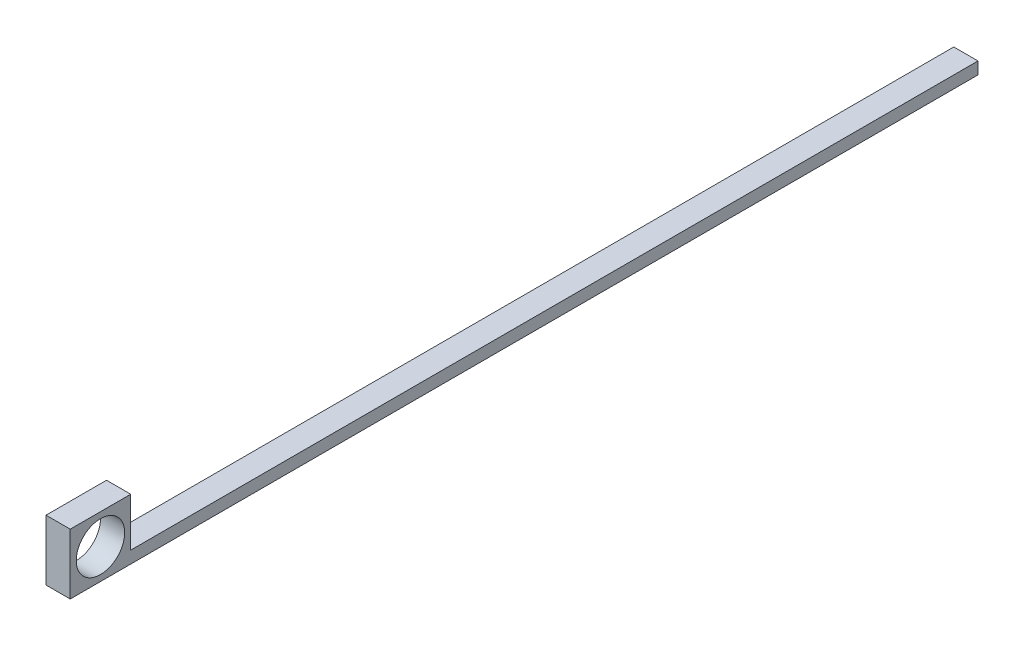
from build123d import *

# Parameters (mm, degrees)
SKETCH1_W           = 50
SKETCH1_H           = 50
SKETCH1_R           = 20
BOSS_EXTRUDE1_DEPTH = 20
SKETCH4_W           = 20
SKETCH4_H           = 10
BOSS_EXTRUDE2_DEPTH = 700


with BuildPart() as part:
    # Sketch1 → Boss-Extrude1 (new body)
    with BuildSketch(Plane(origin=(0, 0, 0), x_dir=(0, 0, -1), z_dir=(1, 0, 0))):
        with Locations((25, 25)):
            Rectangle(SKETCH1_W, SKETCH1_H)
        with Locations((25, 25)):
            Circle(SKETCH1_R, mode=Mode.SUBTRACT)
    extrude(amount=BOSS_EXTRUDE1_DEPTH)

    # Sketch4 → Boss-Extrude2 (add)
    with BuildSketch(Plane(origin=(0, 0, -50), x_dir=(-1, 0, 0), z_dir=(0, 0, -1))):
        with Locations((-10, 5)):
            Rectangle(SKETCH4_W, SKETCH4_H)
    extrude(amount=BOSS_EXTRUDE2_DEPTH)


solid = part.part
